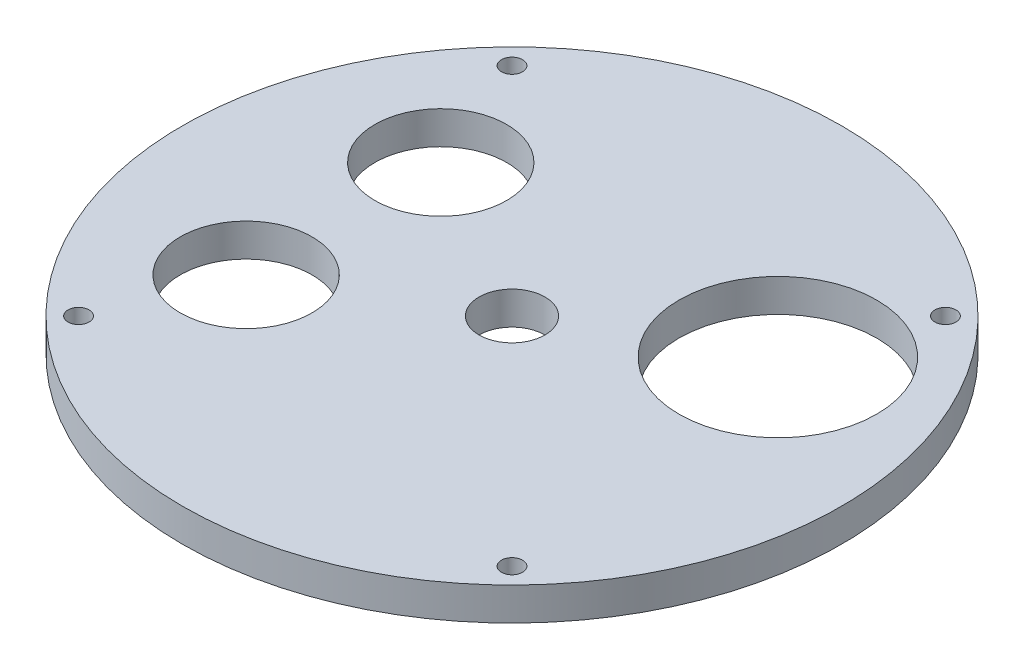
ISO-10303-21;
HEADER;
FILE_DESCRIPTION(('STEP AP214'),'2;1');
FILE_NAME('part.step','',(''),(''),'','','');
FILE_SCHEMA(('AUTOMOTIVE_DESIGN { 1 0 10303 214 1 1 1 1 }'));
ENDSEC;
DATA;
#1=APPLICATION_CONTEXT('core data for automotive mechanical design processes');
#2=APPLICATION_PROTOCOL_DEFINITION('international standard','automotive_design',2000,#1);
#3=PRODUCT_CONTEXT('',#1,'mechanical');
#4=PRODUCT('Part','Part','',(#3));
#5=PRODUCT_RELATED_PRODUCT_CATEGORY('part','',(#4));
#6=PRODUCT_DEFINITION_FORMATION('','',#4);
#7=PRODUCT_DEFINITION_CONTEXT('part definition',#1,'design');
#8=PRODUCT_DEFINITION('design','',#6,#7);
#9=PRODUCT_DEFINITION_SHAPE('','',#8);
#10=(LENGTH_UNIT() NAMED_UNIT(*) SI_UNIT(.MILLI.,.METRE.));
#11=(NAMED_UNIT(*) PLANE_ANGLE_UNIT() SI_UNIT($,.RADIAN.));
#12=(NAMED_UNIT(*) SI_UNIT($,.STERADIAN.) SOLID_ANGLE_UNIT());
#13=UNCERTAINTY_MEASURE_WITH_UNIT(LENGTH_MEASURE(1.E-05),#10,'distance_accuracy_value','');
#14=(GEOMETRIC_REPRESENTATION_CONTEXT(3) GLOBAL_UNCERTAINTY_ASSIGNED_CONTEXT((#13)) GLOBAL_UNIT_ASSIGNED_CONTEXT((#10,
#11,#12)) REPRESENTATION_CONTEXT('',''));
#15=CARTESIAN_POINT('',(0.,0.,0.));
#16=DIRECTION('',(0.,0.,1.));
#17=DIRECTION('',(1.,0.,0.));
#18=AXIS2_PLACEMENT_3D('',#15,#16,#17);
#19=CARTESIAN_POINT('',(0.,6.35,0.));
#20=DIRECTION('',(0.,1.,0.));
#21=DIRECTION('',(0.,0.,1.));
#22=AXIS2_PLACEMENT_3D('',#19,#20,#21);
#23=PLANE('',#22);
#24=CARTESIAN_POINT('',(0.,6.35,0.));
#25=DIRECTION('',(0.,1.,0.));
#26=DIRECTION('',(0.,0.,1.));
#27=AXIS2_PLACEMENT_3D('',#24,#25,#26);
#28=CIRCLE('',#27,6.35);
#29=CARTESIAN_POINT('',(0.,6.35,6.35));
#30=VERTEX_POINT('',#29);
#31=EDGE_CURVE('E109',#30,#30,#28,.T.);
#32=ORIENTED_EDGE('',*,*,#31,.F.);
#33=EDGE_LOOP('',(#32));
#34=FACE_BOUND('',#33,.T.);
#35=CARTESIAN_POINT('',(-32.4759526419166,6.35,18.7499999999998));
#36=DIRECTION('',(0.,1.,0.));
#37=DIRECTION('',(0.,0.,1.));
#38=AXIS2_PLACEMENT_3D('',#35,#36,#37);
#39=CIRCLE('',#38,12.7);
#40=CARTESIAN_POINT('',(-32.4759526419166,6.35,31.4499999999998));
#41=VERTEX_POINT('',#40);
#42=EDGE_CURVE('E77',#41,#41,#39,.T.);
#43=ORIENTED_EDGE('',*,*,#42,.F.);
#44=EDGE_LOOP('',(#43));
#45=FACE_BOUND('',#44,.T.);
#46=CARTESIAN_POINT('',(32.4759526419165,6.35,-18.7499999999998));
#47=DIRECTION('',(0.,1.,0.));
#48=DIRECTION('',(0.,0.,1.));
#49=AXIS2_PLACEMENT_3D('',#46,#47,#48);
#50=CIRCLE('',#49,19.05);
#51=CARTESIAN_POINT('',(32.4759526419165,6.35,0.300000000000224));
#52=VERTEX_POINT('',#51);
#53=EDGE_CURVE('E76',#52,#52,#50,.T.);
#54=ORIENTED_EDGE('',*,*,#53,.F.);
#55=EDGE_LOOP('',(#54));
#56=FACE_BOUND('',#55,.T.);
#57=CARTESIAN_POINT('',(-32.4759526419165,6.35,-18.75));
#58=DIRECTION('',(0.,1.,0.));
#59=DIRECTION('',(0.,0.,1.));
#60=AXIS2_PLACEMENT_3D('',#57,#58,#59);
#61=CIRCLE('',#60,12.7);
#62=CARTESIAN_POINT('',(-32.4759526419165,6.35,-6.05000000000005));
#63=VERTEX_POINT('',#62);
#64=EDGE_CURVE('E70',#63,#63,#61,.T.);
#65=ORIENTED_EDGE('',*,*,#64,.F.);
#66=EDGE_LOOP('',(#65));
#67=FACE_BOUND('',#66,.T.);
#68=CARTESIAN_POINT('',(41.7581909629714,6.35,41.7581909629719));
#69=DIRECTION('',(0.,1.,0.));
#70=DIRECTION('',(0.,0.,1.));
#71=AXIS2_PLACEMENT_3D('',#68,#69,#70);
#72=CIRCLE('',#71,2.032);
#73=CARTESIAN_POINT('',(41.7581909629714,6.35,43.7901909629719));
#74=VERTEX_POINT('',#73);
#75=EDGE_CURVE('E88',#74,#74,#72,.T.);
#76=ORIENTED_EDGE('',*,*,#75,.F.);
#77=EDGE_LOOP('',(#76));
#78=FACE_BOUND('',#77,.T.);
#79=CARTESIAN_POINT('',(-41.7581909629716,6.35,-41.7581909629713));
#80=DIRECTION('',(0.,-1.,0.));
#81=DIRECTION('',(0.,0.,-1.));
#82=AXIS2_PLACEMENT_3D('',#79,#80,#81);
#83=CIRCLE('',#82,2.032);
#84=CARTESIAN_POINT('',(-41.7581909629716,6.35,-43.7901909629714));
#85=VERTEX_POINT('',#84);
#86=EDGE_CURVE('E94',#85,#85,#83,.T.);
#87=ORIENTED_EDGE('',*,*,#86,.T.);
#88=EDGE_LOOP('',(#87));
#89=FACE_BOUND('',#88,.T.);
#90=CARTESIAN_POINT('',(41.7581909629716,6.35,-41.7581909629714));
#91=DIRECTION('',(0.,1.,0.));
#92=DIRECTION('',(0.,0.,1.));
#93=AXIS2_PLACEMENT_3D('',#90,#91,#92);
#94=CIRCLE('',#93,2.032);
#95=CARTESIAN_POINT('',(41.7581909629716,6.35,-39.7261909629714));
#96=VERTEX_POINT('',#95);
#97=EDGE_CURVE('E67',#96,#96,#94,.T.);
#98=ORIENTED_EDGE('',*,*,#97,.F.);
#99=EDGE_LOOP('',(#98));
#100=FACE_BOUND('',#99,.T.);
#101=CARTESIAN_POINT('',(0.,6.35,0.));
#102=DIRECTION('',(0.,1.,0.));
#103=DIRECTION('',(0.,0.,1.));
#104=AXIS2_PLACEMENT_3D('',#101,#102,#103);
#105=CIRCLE('',#104,63.5);
#106=CARTESIAN_POINT('',(0.,6.35,63.5));
#107=VERTEX_POINT('',#106);
#108=EDGE_CURVE('E11',#107,#107,#105,.T.);
#109=ORIENTED_EDGE('',*,*,#108,.T.);
#110=EDGE_LOOP('',(#109));
#111=FACE_BOUND('',#110,.T.);
#112=CARTESIAN_POINT('',(-41.7581909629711,6.35,41.7581909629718));
#113=DIRECTION('',(0.,1.,0.));
#114=DIRECTION('',(0.,0.,1.));
#115=AXIS2_PLACEMENT_3D('',#112,#113,#114);
#116=CIRCLE('',#115,2.03199999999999);
#117=CARTESIAN_POINT('',(-41.7581909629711,6.35,43.7901909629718));
#118=VERTEX_POINT('',#117);
#119=EDGE_CURVE('E101',#118,#118,#116,.F.);
#120=ORIENTED_EDGE('',*,*,#119,.T.);
#121=EDGE_LOOP('',(#120));
#122=FACE_BOUND('',#121,.T.);
#123=ADVANCED_FACE('F54',(#34,#45,#56,#67,#78,#89,#100,#111,#122),#23,.T.);
#124=CARTESIAN_POINT('',(0.,0.,0.));
#125=DIRECTION('',(0.,1.,0.));
#126=DIRECTION('',(0.,0.,1.));
#127=AXIS2_PLACEMENT_3D('',#124,#125,#126);
#128=PLANE('',#127);
#129=CARTESIAN_POINT('',(0.,0.,0.));
#130=DIRECTION('',(0.,1.,0.));
#131=DIRECTION('',(0.,0.,1.));
#132=AXIS2_PLACEMENT_3D('',#129,#130,#131);
#133=CIRCLE('',#132,6.35);
#134=CARTESIAN_POINT('',(0.,0.,6.35));
#135=VERTEX_POINT('',#134);
#136=EDGE_CURVE('E95',#135,#135,#133,.T.);
#137=ORIENTED_EDGE('',*,*,#136,.T.);
#138=EDGE_LOOP('',(#137));
#139=FACE_BOUND('',#138,.T.);
#140=CARTESIAN_POINT('',(-32.4759526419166,0.,18.7499999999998));
#141=DIRECTION('',(0.,1.,0.));
#142=DIRECTION('',(0.,0.,1.));
#143=AXIS2_PLACEMENT_3D('',#140,#141,#142);
#144=CIRCLE('',#143,12.7);
#145=CARTESIAN_POINT('',(-32.4759526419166,0.,31.4499999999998));
#146=VERTEX_POINT('',#145);
#147=EDGE_CURVE('E85',#146,#146,#144,.T.);
#148=ORIENTED_EDGE('',*,*,#147,.T.);
#149=EDGE_LOOP('',(#148));
#150=FACE_BOUND('',#149,.T.);
#151=CARTESIAN_POINT('',(32.4759526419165,0.,-18.7499999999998));
#152=DIRECTION('',(0.,1.,0.));
#153=DIRECTION('',(0.,0.,1.));
#154=AXIS2_PLACEMENT_3D('',#151,#152,#153);
#155=CIRCLE('',#154,19.05);
#156=CARTESIAN_POINT('',(32.4759526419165,0.,0.300000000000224));
#157=VERTEX_POINT('',#156);
#158=EDGE_CURVE('E73',#157,#157,#155,.T.);
#159=ORIENTED_EDGE('',*,*,#158,.T.);
#160=EDGE_LOOP('',(#159));
#161=FACE_BOUND('',#160,.T.);
#162=CARTESIAN_POINT('',(-32.4759526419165,0.,-18.75));
#163=DIRECTION('',(0.,1.,0.));
#164=DIRECTION('',(0.,0.,1.));
#165=AXIS2_PLACEMENT_3D('',#162,#163,#164);
#166=CIRCLE('',#165,12.7);
#167=CARTESIAN_POINT('',(-32.4759526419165,0.,-6.05000000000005));
#168=VERTEX_POINT('',#167);
#169=EDGE_CURVE('E80',#168,#168,#166,.T.);
#170=ORIENTED_EDGE('',*,*,#169,.T.);
#171=EDGE_LOOP('',(#170));
#172=FACE_BOUND('',#171,.T.);
#173=CARTESIAN_POINT('',(41.7581909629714,0.,41.7581909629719));
#174=DIRECTION('',(0.,1.,0.));
#175=DIRECTION('',(0.,0.,1.));
#176=AXIS2_PLACEMENT_3D('',#173,#174,#175);
#177=CIRCLE('',#176,2.032);
#178=CARTESIAN_POINT('',(41.7581909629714,0.,43.7901909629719));
#179=VERTEX_POINT('',#178);
#180=EDGE_CURVE('E104',#179,#179,#177,.T.);
#181=ORIENTED_EDGE('',*,*,#180,.T.);
#182=EDGE_LOOP('',(#181));
#183=FACE_BOUND('',#182,.T.);
#184=CARTESIAN_POINT('',(41.7581909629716,0.,-41.7581909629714));
#185=DIRECTION('',(0.,1.,0.));
#186=DIRECTION('',(0.,0.,1.));
#187=AXIS2_PLACEMENT_3D('',#184,#185,#186);
#188=CIRCLE('',#187,2.032);
#189=CARTESIAN_POINT('',(41.7581909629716,0.,-39.7261909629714));
#190=VERTEX_POINT('',#189);
#191=EDGE_CURVE('E65',#190,#190,#188,.T.);
#192=ORIENTED_EDGE('',*,*,#191,.T.);
#193=EDGE_LOOP('',(#192));
#194=FACE_BOUND('',#193,.T.);
#195=CARTESIAN_POINT('',(0.,0.,0.));
#196=DIRECTION('',(0.,1.,0.));
#197=DIRECTION('',(0.,0.,1.));
#198=AXIS2_PLACEMENT_3D('',#195,#196,#197);
#199=CIRCLE('',#198,63.5);
#200=CARTESIAN_POINT('',(0.,0.,63.5));
#201=VERTEX_POINT('',#200);
#202=EDGE_CURVE('E58',#201,#201,#199,.T.);
#203=ORIENTED_EDGE('',*,*,#202,.F.);
#204=EDGE_LOOP('',(#203));
#205=FACE_BOUND('',#204,.T.);
#206=CARTESIAN_POINT('',(-41.7581909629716,0.,-41.7581909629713));
#207=DIRECTION('',(0.,-1.,0.));
#208=DIRECTION('',(0.,0.,-1.));
#209=AXIS2_PLACEMENT_3D('',#206,#207,#208);
#210=CIRCLE('',#209,2.032);
#211=CARTESIAN_POINT('',(-41.7581909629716,0.,-43.7901909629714));
#212=VERTEX_POINT('',#211);
#213=EDGE_CURVE('E91',#212,#212,#210,.T.);
#214=ORIENTED_EDGE('',*,*,#213,.F.);
#215=EDGE_LOOP('',(#214));
#216=FACE_BOUND('',#215,.T.);
#217=CARTESIAN_POINT('',(-41.7581909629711,0.,41.7581909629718));
#218=DIRECTION('',(0.,1.,0.));
#219=DIRECTION('',(0.,0.,1.));
#220=AXIS2_PLACEMENT_3D('',#217,#218,#219);
#221=CIRCLE('',#220,2.03199999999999);
#222=CARTESIAN_POINT('',(-41.7581909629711,0.,43.7901909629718));
#223=VERTEX_POINT('',#222);
#224=EDGE_CURVE('E98',#223,#223,#221,.F.);
#225=ORIENTED_EDGE('',*,*,#224,.F.);
#226=EDGE_LOOP('',(#225));
#227=FACE_BOUND('',#226,.T.);
#228=ADVANCED_FACE('F115',(#139,#150,#161,#172,#183,#194,#205,#216,#227),#128,.F.);
#229=CARTESIAN_POINT('',(0.,6.35,0.));
#230=DIRECTION('',(0.,-1.,0.));
#231=DIRECTION('',(0.,0.,-1.));
#232=AXIS2_PLACEMENT_3D('',#229,#230,#231);
#233=CYLINDRICAL_SURFACE('',#232,63.5);
#234=ORIENTED_EDGE('',*,*,#108,.F.);
#235=EDGE_LOOP('',(#234));
#236=FACE_BOUND('',#235,.T.);
#237=ORIENTED_EDGE('',*,*,#202,.T.);
#238=EDGE_LOOP('',(#237));
#239=FACE_BOUND('',#238,.T.);
#240=ADVANCED_FACE('F56',(#236,#239),#233,.T.);
#241=CARTESIAN_POINT('',(41.7581909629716,0.,-41.7581909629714));
#242=DIRECTION('',(0.,1.,0.));
#243=DIRECTION('',(0.,0.,1.));
#244=AXIS2_PLACEMENT_3D('',#241,#242,#243);
#245=CYLINDRICAL_SURFACE('',#244,2.032);
#246=ORIENTED_EDGE('',*,*,#191,.F.);
#247=EDGE_LOOP('',(#246));
#248=FACE_BOUND('',#247,.T.);
#249=ORIENTED_EDGE('',*,*,#97,.T.);
#250=EDGE_LOOP('',(#249));
#251=FACE_BOUND('',#250,.T.);
#252=ADVANCED_FACE('F155',(#248,#251),#245,.F.);
#253=CARTESIAN_POINT('',(-41.7581909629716,0.,-41.7581909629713));
#254=DIRECTION('',(0.,1.,0.));
#255=DIRECTION('',(0.,0.,1.));
#256=AXIS2_PLACEMENT_3D('',#253,#254,#255);
#257=CYLINDRICAL_SURFACE('',#256,2.032);
#258=ORIENTED_EDGE('',*,*,#86,.F.);
#259=EDGE_LOOP('',(#258));
#260=FACE_BOUND('',#259,.T.);
#261=ORIENTED_EDGE('',*,*,#213,.T.);
#262=EDGE_LOOP('',(#261));
#263=FACE_BOUND('',#262,.T.);
#264=ADVANCED_FACE('F145',(#260,#263),#257,.F.);
#265=CARTESIAN_POINT('',(-41.7581909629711,0.,41.7581909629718));
#266=DIRECTION('',(0.,1.,0.));
#267=DIRECTION('',(0.,0.,1.));
#268=AXIS2_PLACEMENT_3D('',#265,#266,#267);
#269=CYLINDRICAL_SURFACE('',#268,2.03199999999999);
#270=ORIENTED_EDGE('',*,*,#224,.T.);
#271=EDGE_LOOP('',(#270));
#272=FACE_BOUND('',#271,.T.);
#273=ORIENTED_EDGE('',*,*,#119,.F.);
#274=EDGE_LOOP('',(#273));
#275=FACE_BOUND('',#274,.T.);
#276=ADVANCED_FACE('F142',(#272,#275),#269,.F.);
#277=CARTESIAN_POINT('',(41.7581909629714,0.,41.7581909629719));
#278=DIRECTION('',(0.,1.,0.));
#279=DIRECTION('',(0.,0.,1.));
#280=AXIS2_PLACEMENT_3D('',#277,#278,#279);
#281=CYLINDRICAL_SURFACE('',#280,2.032);
#282=ORIENTED_EDGE('',*,*,#180,.F.);
#283=EDGE_LOOP('',(#282));
#284=FACE_BOUND('',#283,.T.);
#285=ORIENTED_EDGE('',*,*,#75,.T.);
#286=EDGE_LOOP('',(#285));
#287=FACE_BOUND('',#286,.T.);
#288=ADVANCED_FACE('F144',(#284,#287),#281,.F.);
#289=CARTESIAN_POINT('',(-32.4759526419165,0.,-18.75));
#290=DIRECTION('',(0.,1.,0.));
#291=DIRECTION('',(0.,0.,1.));
#292=AXIS2_PLACEMENT_3D('',#289,#290,#291);
#293=CYLINDRICAL_SURFACE('',#292,12.7);
#294=ORIENTED_EDGE('',*,*,#64,.T.);
#295=EDGE_LOOP('',(#294));
#296=FACE_BOUND('',#295,.T.);
#297=ORIENTED_EDGE('',*,*,#169,.F.);
#298=EDGE_LOOP('',(#297));
#299=FACE_BOUND('',#298,.T.);
#300=ADVANCED_FACE('F152',(#296,#299),#293,.F.);
#301=CARTESIAN_POINT('',(32.4759526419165,0.,-18.7499999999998));
#302=DIRECTION('',(0.,1.,0.));
#303=DIRECTION('',(0.,0.,1.));
#304=AXIS2_PLACEMENT_3D('',#301,#302,#303);
#305=CYLINDRICAL_SURFACE('',#304,19.05);
#306=ORIENTED_EDGE('',*,*,#158,.F.);
#307=EDGE_LOOP('',(#306));
#308=FACE_BOUND('',#307,.T.);
#309=ORIENTED_EDGE('',*,*,#53,.T.);
#310=EDGE_LOOP('',(#309));
#311=FACE_BOUND('',#310,.T.);
#312=ADVANCED_FACE('F161',(#308,#311),#305,.F.);
#313=CARTESIAN_POINT('',(-32.4759526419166,0.,18.7499999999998));
#314=DIRECTION('',(0.,1.,0.));
#315=DIRECTION('',(0.,0.,1.));
#316=AXIS2_PLACEMENT_3D('',#313,#314,#315);
#317=CYLINDRICAL_SURFACE('',#316,12.7);
#318=ORIENTED_EDGE('',*,*,#147,.F.);
#319=EDGE_LOOP('',(#318));
#320=FACE_BOUND('',#319,.T.);
#321=ORIENTED_EDGE('',*,*,#42,.T.);
#322=EDGE_LOOP('',(#321));
#323=FACE_BOUND('',#322,.T.);
#324=ADVANCED_FACE('F121',(#320,#323),#317,.F.);
#325=CARTESIAN_POINT('',(0.,0.,0.));
#326=DIRECTION('',(0.,1.,0.));
#327=DIRECTION('',(0.,0.,1.));
#328=AXIS2_PLACEMENT_3D('',#325,#326,#327);
#329=CYLINDRICAL_SURFACE('',#328,6.35);
#330=ORIENTED_EDGE('',*,*,#136,.F.);
#331=EDGE_LOOP('',(#330));
#332=FACE_BOUND('',#331,.T.);
#333=ORIENTED_EDGE('',*,*,#31,.T.);
#334=EDGE_LOOP('',(#333));
#335=FACE_BOUND('',#334,.T.);
#336=ADVANCED_FACE('F118',(#332,#335),#329,.F.);
#337=CLOSED_SHELL('',(#123,#228,#240,#252,#264,#276,#288,#300,#312,#324,#336));
#338=MANIFOLD_SOLID_BREP('B2',#337);
#339=ADVANCED_BREP_SHAPE_REPRESENTATION('',(#18,#338),#14);
#340=SHAPE_DEFINITION_REPRESENTATION(#9,#339);
ENDSEC;
END-ISO-10303-21;
